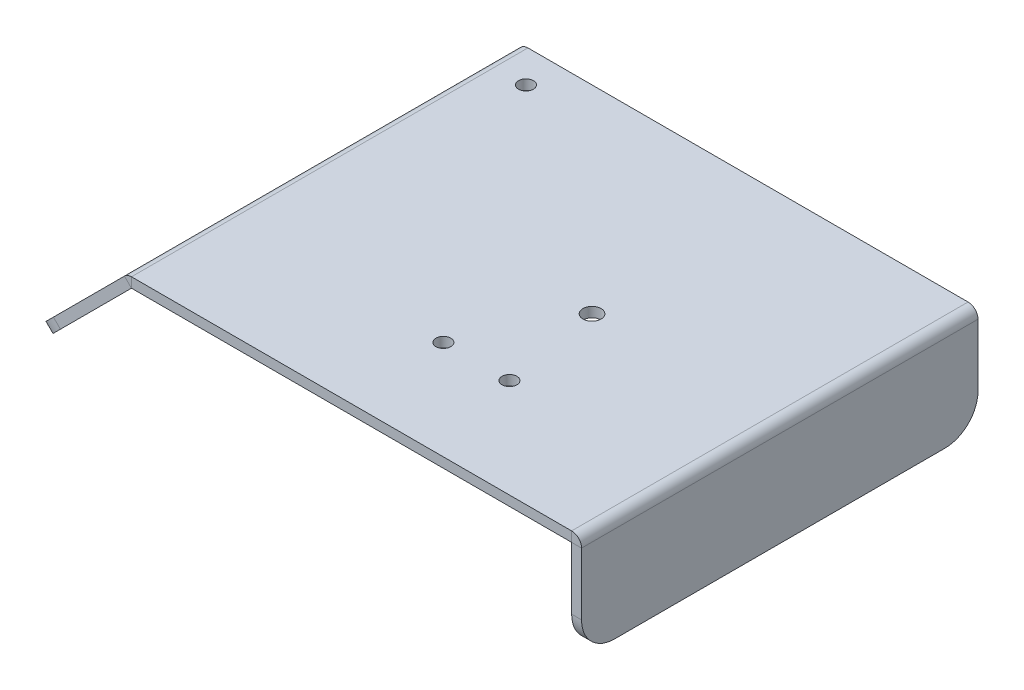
ISO-10303-21;
HEADER;
FILE_DESCRIPTION(('STEP AP214'),'2;1');
FILE_NAME('part.step','',(''),(''),'','','');
FILE_SCHEMA(('AUTOMOTIVE_DESIGN { 1 0 10303 214 1 1 1 1 }'));
ENDSEC;
DATA;
#1=APPLICATION_CONTEXT('core data for automotive mechanical design processes');
#2=APPLICATION_PROTOCOL_DEFINITION('international standard','automotive_design',2000,#1);
#3=PRODUCT_CONTEXT('',#1,'mechanical');
#4=PRODUCT('Part','Part','',(#3));
#5=PRODUCT_RELATED_PRODUCT_CATEGORY('part','',(#4));
#6=PRODUCT_DEFINITION_FORMATION('','',#4);
#7=PRODUCT_DEFINITION_CONTEXT('part definition',#1,'design');
#8=PRODUCT_DEFINITION('design','',#6,#7);
#9=PRODUCT_DEFINITION_SHAPE('','',#8);
#10=(LENGTH_UNIT() NAMED_UNIT(*) SI_UNIT(.MILLI.,.METRE.));
#11=(NAMED_UNIT(*) PLANE_ANGLE_UNIT() SI_UNIT($,.RADIAN.));
#12=(NAMED_UNIT(*) SI_UNIT($,.STERADIAN.) SOLID_ANGLE_UNIT());
#13=UNCERTAINTY_MEASURE_WITH_UNIT(LENGTH_MEASURE(1.E-05),#10,'distance_accuracy_value','');
#14=(GEOMETRIC_REPRESENTATION_CONTEXT(3) GLOBAL_UNCERTAINTY_ASSIGNED_CONTEXT((#13)) GLOBAL_UNIT_ASSIGNED_CONTEXT((#10,
#11,#12)) REPRESENTATION_CONTEXT('',''));
#15=CARTESIAN_POINT('',(0.,0.,0.));
#16=DIRECTION('',(0.,0.,1.));
#17=DIRECTION('',(1.,0.,0.));
#18=AXIS2_PLACEMENT_3D('',#15,#16,#17);
#19=CARTESIAN_POINT('',(10.0000000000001,3.,0.));
#20=DIRECTION('',(0.,0.,-1.));
#21=DIRECTION('',(-1.,0.,0.));
#22=AXIS2_PLACEMENT_3D('',#19,#20,#21);
#23=PLANE('',#22);
#24=DIRECTION('',(1.,0.,0.));
#25=VECTOR('',#24,1.);
#26=CARTESIAN_POINT('',(10.0000000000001,3.,0.));
#27=LINE('',#26,#25);
#28=CARTESIAN_POINT('',(41.5929756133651,2.99999997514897,0.));
#29=VERTEX_POINT('',#28);
#30=CARTESIAN_POINT('',(174.81404877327,3.,0.));
#31=VERTEX_POINT('',#30);
#32=EDGE_CURVE('E43',#29,#31,#27,.T.);
#33=ORIENTED_EDGE('',*,*,#32,.F.);
#34=DIRECTION('',(0.,-1.,0.));
#35=VECTOR('',#34,1.);
#36=CARTESIAN_POINT('',(41.5929756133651,3.,0.));
#37=LINE('',#36,#35);
#38=CARTESIAN_POINT('',(41.5929756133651,0.,0.));
#39=VERTEX_POINT('',#38);
#40=EDGE_CURVE('E12',#29,#39,#37,.T.);
#41=ORIENTED_EDGE('',*,*,#40,.T.);
#42=DIRECTION('',(1.,0.,0.));
#43=VECTOR('',#42,1.);
#44=CARTESIAN_POINT('',(10.0000000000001,0.,0.));
#45=LINE('',#44,#43);
#46=CARTESIAN_POINT('',(174.81404877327,0.,0.));
#47=VERTEX_POINT('',#46);
#48=EDGE_CURVE('E227',#39,#47,#45,.T.);
#49=ORIENTED_EDGE('',*,*,#48,.T.);
#50=DIRECTION('',(0.,-1.,0.));
#51=VECTOR('',#50,1.);
#52=CARTESIAN_POINT('',(174.81404877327,3.,0.));
#53=LINE('',#52,#51);
#54=EDGE_CURVE('E223',#31,#47,#53,.T.);
#55=ORIENTED_EDGE('',*,*,#54,.F.);
#56=EDGE_LOOP('',(#33,#41,#49,#55));
#57=FACE_BOUND('',#56,.T.);
#58=ADVANCED_FACE('F40',(#57),#23,.F.);
#59=CARTESIAN_POINT('',(196.,0.,-110.));
#60=DIRECTION('',(0.,1.,0.));
#61=DIRECTION('',(0.,0.,1.));
#62=AXIS2_PLACEMENT_3D('',#59,#60,#61);
#63=PLANE('',#62);
#64=CARTESIAN_POINT('',(121.,0.,-60.));
#65=DIRECTION('',(0.,1.,0.));
#66=DIRECTION('',(0.,0.,1.));
#67=AXIS2_PLACEMENT_3D('',#64,#65,#66);
#68=CIRCLE('',#67,2.75000000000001);
#69=CARTESIAN_POINT('',(121.,0.,-57.25));
#70=VERTEX_POINT('',#69);
#71=EDGE_CURVE('E224',#70,#70,#68,.T.);
#72=ORIENTED_EDGE('',*,*,#71,.T.);
#73=EDGE_LOOP('',(#72));
#74=FACE_BOUND('',#73,.T.);
#75=CARTESIAN_POINT('',(106.,0.,-30.));
#76=DIRECTION('',(0.,1.,0.));
#77=DIRECTION('',(0.,0.,1.));
#78=AXIS2_PLACEMENT_3D('',#75,#76,#77);
#79=CIRCLE('',#78,2.25);
#80=CARTESIAN_POINT('',(106.,0.,-27.75));
#81=VERTEX_POINT('',#80);
#82=EDGE_CURVE('E228',#81,#81,#79,.T.);
#83=ORIENTED_EDGE('',*,*,#82,.T.);
#84=EDGE_LOOP('',(#83));
#85=FACE_BOUND('',#84,.T.);
#86=CARTESIAN_POINT('',(51.,0.,-110.));
#87=DIRECTION('',(0.,1.,0.));
#88=DIRECTION('',(0.,0.,1.));
#89=AXIS2_PLACEMENT_3D('',#86,#87,#88);
#90=CIRCLE('',#89,2.25);
#91=CARTESIAN_POINT('',(51.,0.,-107.75));
#92=VERTEX_POINT('',#91);
#93=EDGE_CURVE('E231',#92,#92,#90,.T.);
#94=ORIENTED_EDGE('',*,*,#93,.T.);
#95=EDGE_LOOP('',(#94));
#96=FACE_BOUND('',#95,.T.);
#97=CARTESIAN_POINT('',(126.,0.,-30.));
#98=DIRECTION('',(0.,1.,0.));
#99=DIRECTION('',(0.,0.,1.));
#100=AXIS2_PLACEMENT_3D('',#97,#98,#99);
#101=CIRCLE('',#100,2.25000000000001);
#102=CARTESIAN_POINT('',(126.,0.,-27.75));
#103=VERTEX_POINT('',#102);
#104=EDGE_CURVE('E234',#103,#103,#101,.T.);
#105=ORIENTED_EDGE('',*,*,#104,.T.);
#106=EDGE_LOOP('',(#105));
#107=FACE_BOUND('',#106,.T.);
#108=ORIENTED_EDGE('',*,*,#48,.F.);
#109=DIRECTION('',(0.,0.,-1.));
#110=VECTOR('',#109,1.);
#111=CARTESIAN_POINT('',(41.5929756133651,0.,-110.));
#112=LINE('',#111,#110);
#113=CARTESIAN_POINT('',(41.5929756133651,-2.9114793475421E-08,-120.));
#114=VERTEX_POINT('',#113);
#115=EDGE_CURVE('E48',#39,#114,#112,.T.);
#116=ORIENTED_EDGE('',*,*,#115,.T.);
#117=DIRECTION('',(-1.,0.,0.));
#118=VECTOR('',#117,1.);
#119=CARTESIAN_POINT('',(10.0000000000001,0.,-120.));
#120=LINE('',#119,#118);
#121=CARTESIAN_POINT('',(174.81404877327,0.,-120.));
#122=VERTEX_POINT('',#121);
#123=EDGE_CURVE('E237',#122,#114,#120,.T.);
#124=ORIENTED_EDGE('',*,*,#123,.F.);
#125=DIRECTION('',(0.,0.,-1.));
#126=VECTOR('',#125,1.);
#127=CARTESIAN_POINT('',(174.81404877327,0.,-110.));
#128=LINE('',#127,#126);
#129=EDGE_CURVE('E257',#47,#122,#128,.T.);
#130=ORIENTED_EDGE('',*,*,#129,.F.);
#131=EDGE_LOOP('',(#108,#116,#124,#130));
#132=FACE_BOUND('',#131,.T.);
#133=ADVANCED_FACE('F375',(#74,#85,#96,#107,#132),#63,.F.);
#134=CARTESIAN_POINT('',(10.0000000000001,3.,-120.));
#135=DIRECTION('',(0.,0.,1.));
#136=DIRECTION('',(1.,0.,0.));
#137=AXIS2_PLACEMENT_3D('',#134,#135,#136);
#138=PLANE('',#137);
#139=ORIENTED_EDGE('',*,*,#123,.T.);
#140=DIRECTION('',(0.,1.,0.));
#141=VECTOR('',#140,1.);
#142=CARTESIAN_POINT('',(41.5929756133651,3.,-120.));
#143=LINE('',#142,#141);
#144=CARTESIAN_POINT('',(41.5929756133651,2.99999997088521,-120.));
#145=VERTEX_POINT('',#144);
#146=EDGE_CURVE('E307',#114,#145,#143,.T.);
#147=ORIENTED_EDGE('',*,*,#146,.T.);
#148=DIRECTION('',(-1.,0.,0.));
#149=VECTOR('',#148,1.);
#150=CARTESIAN_POINT('',(10.0000000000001,3.,-120.));
#151=LINE('',#150,#149);
#152=CARTESIAN_POINT('',(174.81404877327,3.00000012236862,-120.));
#153=VERTEX_POINT('',#152);
#154=EDGE_CURVE('E241',#153,#145,#151,.T.);
#155=ORIENTED_EDGE('',*,*,#154,.F.);
#156=DIRECTION('',(0.,1.,0.));
#157=VECTOR('',#156,1.);
#158=CARTESIAN_POINT('',(174.81404877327,3.,-120.));
#159=LINE('',#158,#157);
#160=EDGE_CURVE('E254',#122,#153,#159,.T.);
#161=ORIENTED_EDGE('',*,*,#160,.F.);
#162=EDGE_LOOP('',(#139,#147,#155,#161));
#163=FACE_BOUND('',#162,.T.);
#164=ADVANCED_FACE('F323',(#163),#138,.F.);
#165=CARTESIAN_POINT('',(177.82404877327,167.17595122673,0.));
#166=DIRECTION('',(0.,0.,-1.));
#167=DIRECTION('',(0.,1.,0.));
#168=AXIS2_PLACEMENT_3D('',#165,#166,#167);
#169=PLANE('',#168);
#170=DIRECTION('',(0.,-1.,0.));
#171=VECTOR('',#170,1.);
#172=CARTESIAN_POINT('',(177.82404877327,167.17595122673,0.));
#173=LINE('',#172,#171);
#174=CARTESIAN_POINT('',(177.82404877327,-0.01000000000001,0.));
#175=VERTEX_POINT('',#174);
#176=CARTESIAN_POINT('',(177.82404877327,-18.8240487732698,0.));
#177=VERTEX_POINT('',#176);
#178=EDGE_CURVE('E277',#175,#177,#173,.T.);
#179=ORIENTED_EDGE('',*,*,#178,.F.);
#180=DIRECTION('',(-1.,0.,0.));
#181=VECTOR('',#180,1.);
#182=CARTESIAN_POINT('',(177.82404877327,-0.01000000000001,0.));
#183=LINE('',#182,#181);
#184=CARTESIAN_POINT('',(174.82404877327,-0.01000000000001,0.));
#185=VERTEX_POINT('',#184);
#186=EDGE_CURVE('E298',#175,#185,#183,.T.);
#187=ORIENTED_EDGE('',*,*,#186,.T.);
#188=DIRECTION('',(0.,-1.,0.));
#189=VECTOR('',#188,1.);
#190=CARTESIAN_POINT('',(174.82404877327,167.17595122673,0.));
#191=LINE('',#190,#189);
#192=CARTESIAN_POINT('',(174.82404877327,-18.8240487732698,0.));
#193=VERTEX_POINT('',#192);
#194=EDGE_CURVE('E64',#185,#193,#191,.T.);
#195=ORIENTED_EDGE('',*,*,#194,.T.);
#196=DIRECTION('',(-1.,0.,0.));
#197=VECTOR('',#196,1.);
#198=CARTESIAN_POINT('',(177.82404877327,-18.8240487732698,0.));
#199=LINE('',#198,#197);
#200=EDGE_CURVE('E285',#177,#193,#199,.T.);
#201=ORIENTED_EDGE('',*,*,#200,.F.);
#202=EDGE_LOOP('',(#179,#187,#195,#201));
#203=FACE_BOUND('',#202,.T.);
#204=ADVANCED_FACE('F394',(#203),#169,.F.);
#205=CARTESIAN_POINT('',(177.82404877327,167.17595122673,-120.));
#206=DIRECTION('',(0.,0.,1.));
#207=DIRECTION('',(0.,-1.,0.));
#208=AXIS2_PLACEMENT_3D('',#205,#206,#207);
#209=PLANE('',#208);
#210=DIRECTION('',(0.,1.,0.));
#211=VECTOR('',#210,1.);
#212=CARTESIAN_POINT('',(174.82404877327,167.17595122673,-120.));
#213=LINE('',#212,#211);
#214=CARTESIAN_POINT('',(174.82404877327,-18.8240487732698,-120.));
#215=VERTEX_POINT('',#214);
#216=CARTESIAN_POINT('',(174.82404877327,-0.01000000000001,-120.));
#217=VERTEX_POINT('',#216);
#218=EDGE_CURVE('E265',#215,#217,#213,.T.);
#219=ORIENTED_EDGE('',*,*,#218,.T.);
#220=DIRECTION('',(1.,0.,0.));
#221=VECTOR('',#220,1.);
#222=CARTESIAN_POINT('',(177.82404877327,-0.01000000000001,-120.));
#223=LINE('',#222,#221);
#224=CARTESIAN_POINT('',(177.824048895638,-0.0100000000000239,-120.));
#225=VERTEX_POINT('',#224);
#226=EDGE_CURVE('E294',#217,#225,#223,.T.);
#227=ORIENTED_EDGE('',*,*,#226,.T.);
#228=DIRECTION('',(0.,1.,0.));
#229=VECTOR('',#228,1.);
#230=CARTESIAN_POINT('',(177.82404877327,167.17595122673,-120.));
#231=LINE('',#230,#229);
#232=CARTESIAN_POINT('',(177.82404877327,-18.8240487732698,-120.));
#233=VERTEX_POINT('',#232);
#234=EDGE_CURVE('E273',#233,#225,#231,.T.);
#235=ORIENTED_EDGE('',*,*,#234,.F.);
#236=DIRECTION('',(-1.,0.,0.));
#237=VECTOR('',#236,1.);
#238=CARTESIAN_POINT('',(177.82404877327,-18.8240487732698,-120.));
#239=LINE('',#238,#237);
#240=EDGE_CURVE('E288',#233,#215,#239,.T.);
#241=ORIENTED_EDGE('',*,*,#240,.T.);
#242=EDGE_LOOP('',(#219,#227,#235,#241));
#243=FACE_BOUND('',#242,.T.);
#244=ADVANCED_FACE('F405',(#243),#209,.F.);
#245=CARTESIAN_POINT('',(174.82404877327,-18.8240487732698,-110.));
#246=DIRECTION('',(1.,0.,0.));
#247=DIRECTION('',(0.,0.,1.));
#248=AXIS2_PLACEMENT_3D('',#245,#246,#247);
#249=PLANE('',#248);
#250=ORIENTED_EDGE('',*,*,#194,.F.);
#251=DIRECTION('',(0.,0.,-1.));
#252=VECTOR('',#251,1.);
#253=CARTESIAN_POINT('',(174.82404877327,-0.01000000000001,-110.));
#254=LINE('',#253,#252);
#255=EDGE_CURVE('E296',#185,#217,#254,.T.);
#256=ORIENTED_EDGE('',*,*,#255,.T.);
#257=ORIENTED_EDGE('',*,*,#218,.F.);
#258=CARTESIAN_POINT('',(174.82404877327,-18.8240487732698,-110.));
#259=DIRECTION('',(1.,0.,0.));
#260=DIRECTION('',(0.,0.,1.));
#261=AXIS2_PLACEMENT_3D('',#258,#259,#260);
#262=CIRCLE('',#261,10.);
#263=CARTESIAN_POINT('',(174.82404877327,-28.8240487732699,-110.));
#264=VERTEX_POINT('',#263);
#265=EDGE_CURVE('E262',#264,#215,#262,.T.);
#266=ORIENTED_EDGE('',*,*,#265,.F.);
#267=DIRECTION('',(0.,0.,-1.));
#268=VECTOR('',#267,1.);
#269=CARTESIAN_POINT('',(174.82404877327,-28.8240487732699,-10.0000000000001));
#270=LINE('',#269,#268);
#271=CARTESIAN_POINT('',(174.82404877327,-28.8240487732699,-10.0000000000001));
#272=VERTEX_POINT('',#271);
#273=EDGE_CURVE('E268',#272,#264,#270,.T.);
#274=ORIENTED_EDGE('',*,*,#273,.F.);
#275=CARTESIAN_POINT('',(174.82404877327,-18.8240487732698,-10.));
#276=DIRECTION('',(1.,0.,0.));
#277=DIRECTION('',(0.,0.,1.));
#278=AXIS2_PLACEMENT_3D('',#275,#276,#277);
#279=CIRCLE('',#278,10.);
#280=EDGE_CURVE('E266',#193,#272,#279,.T.);
#281=ORIENTED_EDGE('',*,*,#280,.F.);
#282=EDGE_LOOP('',(#250,#256,#257,#266,#274,#281));
#283=FACE_BOUND('',#282,.T.);
#284=ADVANCED_FACE('F400',(#283),#249,.F.);
#285=CARTESIAN_POINT('',(177.82404877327,-18.8240487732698,-110.));
#286=DIRECTION('',(1.,0.,0.));
#287=DIRECTION('',(0.,0.,1.));
#288=AXIS2_PLACEMENT_3D('',#285,#286,#287);
#289=PLANE('',#288);
#290=DIRECTION('',(0.,0.,-1.));
#291=VECTOR('',#290,1.);
#292=CARTESIAN_POINT('',(177.82404877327,-0.01000000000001,-110.));
#293=LINE('',#292,#291);
#294=EDGE_CURVE('E291',#175,#225,#293,.T.);
#295=ORIENTED_EDGE('',*,*,#294,.F.);
#296=ORIENTED_EDGE('',*,*,#178,.T.);
#297=CARTESIAN_POINT('',(177.82404877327,-18.8240487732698,-10.));
#298=DIRECTION('',(1.,0.,0.));
#299=DIRECTION('',(0.,0.,1.));
#300=AXIS2_PLACEMENT_3D('',#297,#298,#299);
#301=CIRCLE('',#300,10.);
#302=CARTESIAN_POINT('',(177.82404877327,-28.8240487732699,-10.0000000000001));
#303=VERTEX_POINT('',#302);
#304=EDGE_CURVE('E274',#177,#303,#301,.T.);
#305=ORIENTED_EDGE('',*,*,#304,.T.);
#306=DIRECTION('',(0.,0.,-1.));
#307=VECTOR('',#306,1.);
#308=CARTESIAN_POINT('',(177.82404877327,-28.8240487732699,-10.0000000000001));
#309=LINE('',#308,#307);
#310=CARTESIAN_POINT('',(177.82404877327,-28.8240487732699,-110.));
#311=VERTEX_POINT('',#310);
#312=EDGE_CURVE('E276',#303,#311,#309,.T.);
#313=ORIENTED_EDGE('',*,*,#312,.T.);
#314=CARTESIAN_POINT('',(177.82404877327,-18.8240487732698,-110.));
#315=DIRECTION('',(1.,0.,0.));
#316=DIRECTION('',(0.,0.,1.));
#317=AXIS2_PLACEMENT_3D('',#314,#315,#316);
#318=CIRCLE('',#317,10.);
#319=EDGE_CURVE('E270',#311,#233,#318,.T.);
#320=ORIENTED_EDGE('',*,*,#319,.T.);
#321=ORIENTED_EDGE('',*,*,#234,.T.);
#322=EDGE_LOOP('',(#295,#296,#305,#313,#320,#321));
#323=FACE_BOUND('',#322,.T.);
#324=ADVANCED_FACE('F407',(#323),#289,.T.);
#325=CARTESIAN_POINT('',(177.82404877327,-18.8240487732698,-110.));
#326=DIRECTION('',(-1.,0.,0.));
#327=DIRECTION('',(0.,0.,-1.));
#328=AXIS2_PLACEMENT_3D('',#325,#326,#327);
#329=CYLINDRICAL_SURFACE('',#328,10.);
#330=ORIENTED_EDGE('',*,*,#265,.T.);
#331=ORIENTED_EDGE('',*,*,#240,.F.);
#332=ORIENTED_EDGE('',*,*,#319,.F.);
#333=DIRECTION('',(-1.,0.,0.));
#334=VECTOR('',#333,1.);
#335=CARTESIAN_POINT('',(177.82404877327,-28.8240487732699,-110.));
#336=LINE('',#335,#334);
#337=EDGE_CURVE('E279',#311,#264,#336,.T.);
#338=ORIENTED_EDGE('',*,*,#337,.T.);
#339=EDGE_LOOP('',(#330,#331,#332,#338));
#340=FACE_BOUND('',#339,.T.);
#341=ADVANCED_FACE('F413',(#340),#329,.T.);
#342=CARTESIAN_POINT('',(177.82404877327,-18.8240487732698,-10.));
#343=DIRECTION('',(-1.,0.,0.));
#344=DIRECTION('',(0.,0.,-1.));
#345=AXIS2_PLACEMENT_3D('',#342,#343,#344);
#346=CYLINDRICAL_SURFACE('',#345,10.);
#347=ORIENTED_EDGE('',*,*,#280,.T.);
#348=DIRECTION('',(-1.,0.,0.));
#349=VECTOR('',#348,1.);
#350=CARTESIAN_POINT('',(177.82404877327,-28.8240487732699,-10.0000000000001));
#351=LINE('',#350,#349);
#352=EDGE_CURVE('E282',#303,#272,#351,.T.);
#353=ORIENTED_EDGE('',*,*,#352,.F.);
#354=ORIENTED_EDGE('',*,*,#304,.F.);
#355=ORIENTED_EDGE('',*,*,#200,.T.);
#356=EDGE_LOOP('',(#347,#353,#354,#355));
#357=FACE_BOUND('',#356,.T.);
#358=ADVANCED_FACE('F420',(#357),#346,.T.);
#359=CARTESIAN_POINT('',(177.82404877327,-28.8240487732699,-10.0000000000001));
#360=DIRECTION('',(0.,1.,0.));
#361=DIRECTION('',(0.,0.,1.));
#362=AXIS2_PLACEMENT_3D('',#359,#360,#361);
#363=PLANE('',#362);
#364=ORIENTED_EDGE('',*,*,#273,.T.);
#365=ORIENTED_EDGE('',*,*,#337,.F.);
#366=ORIENTED_EDGE('',*,*,#312,.F.);
#367=ORIENTED_EDGE('',*,*,#352,.T.);
#368=EDGE_LOOP('',(#364,#365,#366,#367));
#369=FACE_BOUND('',#368,.T.);
#370=ADVANCED_FACE('F416',(#369),#363,.F.);
#371=CARTESIAN_POINT('',(121.,3.,-60.));
#372=DIRECTION('',(0.,-1.,0.));
#373=DIRECTION('',(0.,0.,-1.));
#374=AXIS2_PLACEMENT_3D('',#371,#372,#373);
#375=CYLINDRICAL_SURFACE('',#374,2.75000000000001);
#376=CARTESIAN_POINT('',(121.,3.,-60.));
#377=DIRECTION('',(0.,1.,0.));
#378=DIRECTION('',(0.,0.,1.));
#379=AXIS2_PLACEMENT_3D('',#376,#377,#378);
#380=CIRCLE('',#379,2.75000000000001);
#381=CARTESIAN_POINT('',(121.,3.,-57.25));
#382=VERTEX_POINT('',#381);
#383=EDGE_CURVE('E251',#382,#382,#380,.T.);
#384=ORIENTED_EDGE('',*,*,#383,.T.);
#385=EDGE_LOOP('',(#384));
#386=FACE_BOUND('',#385,.T.);
#387=ORIENTED_EDGE('',*,*,#71,.F.);
#388=EDGE_LOOP('',(#387));
#389=FACE_BOUND('',#388,.T.);
#390=ADVANCED_FACE('F427',(#386,#389),#375,.F.);
#391=CARTESIAN_POINT('',(106.,3.,-30.));
#392=DIRECTION('',(0.,-1.,0.));
#393=DIRECTION('',(0.,0.,-1.));
#394=AXIS2_PLACEMENT_3D('',#391,#392,#393);
#395=CYLINDRICAL_SURFACE('',#394,2.25);
#396=CARTESIAN_POINT('',(106.,3.,-30.));
#397=DIRECTION('',(0.,1.,0.));
#398=DIRECTION('',(0.,0.,1.));
#399=AXIS2_PLACEMENT_3D('',#396,#397,#398);
#400=CIRCLE('',#399,2.25);
#401=CARTESIAN_POINT('',(106.,3.,-27.75));
#402=VERTEX_POINT('',#401);
#403=EDGE_CURVE('E248',#402,#402,#400,.T.);
#404=ORIENTED_EDGE('',*,*,#403,.T.);
#405=EDGE_LOOP('',(#404));
#406=FACE_BOUND('',#405,.T.);
#407=ORIENTED_EDGE('',*,*,#82,.F.);
#408=EDGE_LOOP('',(#407));
#409=FACE_BOUND('',#408,.T.);
#410=ADVANCED_FACE('F492',(#406,#409),#395,.F.);
#411=CARTESIAN_POINT('',(51.,3.,-110.));
#412=DIRECTION('',(0.,-1.,0.));
#413=DIRECTION('',(0.,0.,-1.));
#414=AXIS2_PLACEMENT_3D('',#411,#412,#413);
#415=CYLINDRICAL_SURFACE('',#414,2.25);
#416=CARTESIAN_POINT('',(51.,3.,-110.));
#417=DIRECTION('',(0.,1.,0.));
#418=DIRECTION('',(0.,0.,1.));
#419=AXIS2_PLACEMENT_3D('',#416,#417,#418);
#420=CIRCLE('',#419,2.25);
#421=CARTESIAN_POINT('',(51.,3.,-107.75));
#422=VERTEX_POINT('',#421);
#423=EDGE_CURVE('E245',#422,#422,#420,.T.);
#424=ORIENTED_EDGE('',*,*,#423,.T.);
#425=EDGE_LOOP('',(#424));
#426=FACE_BOUND('',#425,.T.);
#427=ORIENTED_EDGE('',*,*,#93,.F.);
#428=EDGE_LOOP('',(#427));
#429=FACE_BOUND('',#428,.T.);
#430=ADVANCED_FACE('F504',(#426,#429),#415,.F.);
#431=CARTESIAN_POINT('',(126.,3.,-30.));
#432=DIRECTION('',(0.,-1.,0.));
#433=DIRECTION('',(0.,0.,-1.));
#434=AXIS2_PLACEMENT_3D('',#431,#432,#433);
#435=CYLINDRICAL_SURFACE('',#434,2.25000000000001);
#436=CARTESIAN_POINT('',(126.,3.,-30.));
#437=DIRECTION('',(0.,1.,0.));
#438=DIRECTION('',(0.,0.,1.));
#439=AXIS2_PLACEMENT_3D('',#436,#437,#438);
#440=CIRCLE('',#439,2.25000000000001);
#441=CARTESIAN_POINT('',(126.,3.,-27.75));
#442=VERTEX_POINT('',#441);
#443=EDGE_CURVE('E242',#442,#442,#440,.T.);
#444=ORIENTED_EDGE('',*,*,#443,.T.);
#445=EDGE_LOOP('',(#444));
#446=FACE_BOUND('',#445,.T.);
#447=ORIENTED_EDGE('',*,*,#104,.F.);
#448=EDGE_LOOP('',(#447));
#449=FACE_BOUND('',#448,.T.);
#450=ADVANCED_FACE('F442',(#446,#449),#435,.F.);
#451=CARTESIAN_POINT('',(196.,3.,-110.));
#452=DIRECTION('',(0.,1.,0.));
#453=DIRECTION('',(0.,0.,1.));
#454=AXIS2_PLACEMENT_3D('',#451,#452,#453);
#455=PLANE('',#454);
#456=DIRECTION('',(0.,0.,-1.));
#457=VECTOR('',#456,1.);
#458=CARTESIAN_POINT('',(41.5929756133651,3.,-110.));
#459=LINE('',#458,#457);
#460=EDGE_CURVE('E300',#29,#145,#459,.T.);
#461=ORIENTED_EDGE('',*,*,#460,.F.);
#462=ORIENTED_EDGE('',*,*,#32,.T.);
#463=DIRECTION('',(0.,0.,-1.));
#464=VECTOR('',#463,1.);
#465=CARTESIAN_POINT('',(174.81404877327,3.,-110.));
#466=LINE('',#465,#464);
#467=EDGE_CURVE('E238',#31,#153,#466,.T.);
#468=ORIENTED_EDGE('',*,*,#467,.T.);
#469=ORIENTED_EDGE('',*,*,#154,.T.);
#470=EDGE_LOOP('',(#461,#462,#468,#469));
#471=FACE_BOUND('',#470,.T.);
#472=ORIENTED_EDGE('',*,*,#443,.F.);
#473=EDGE_LOOP('',(#472));
#474=FACE_BOUND('',#473,.T.);
#475=ORIENTED_EDGE('',*,*,#423,.F.);
#476=EDGE_LOOP('',(#475));
#477=FACE_BOUND('',#476,.T.);
#478=ORIENTED_EDGE('',*,*,#403,.F.);
#479=EDGE_LOOP('',(#478));
#480=FACE_BOUND('',#479,.T.);
#481=ORIENTED_EDGE('',*,*,#383,.F.);
#482=EDGE_LOOP('',(#481));
#483=FACE_BOUND('',#482,.T.);
#484=ADVANCED_FACE('F317',(#471,#474,#477,#480,#483),#455,.T.);
#485=CARTESIAN_POINT('',(174.81404877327,-0.0100001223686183,0.));
#486=DIRECTION('',(0.,0.,1.));
#487=DIRECTION('',(0.,-1.,0.));
#488=AXIS2_PLACEMENT_3D('',#485,#486,#487);
#489=PLANE('',#488);
#490=ORIENTED_EDGE('',*,*,#54,.T.);
#491=CARTESIAN_POINT('',(174.81404877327,-0.01,0.));
#492=DIRECTION('',(0.,0.,-1.));
#493=DIRECTION('',(-1.,0.,0.));
#494=AXIS2_PLACEMENT_3D('',#491,#492,#493);
#495=CIRCLE('',#494,0.0100001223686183);
#496=EDGE_CURVE('E211',#47,#185,#495,.T.);
#497=ORIENTED_EDGE('',*,*,#496,.T.);
#498=ORIENTED_EDGE('',*,*,#186,.F.);
#499=CARTESIAN_POINT('',(174.81404877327,-0.0100001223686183,0.));
#500=DIRECTION('',(0.,0.,-1.));
#501=DIRECTION('',(0.,1.,0.));
#502=AXIS2_PLACEMENT_3D('',#499,#500,#501);
#503=CIRCLE('',#502,3.01000018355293);
#504=EDGE_CURVE('E217',#31,#175,#503,.T.);
#505=ORIENTED_EDGE('',*,*,#504,.F.);
#506=EDGE_LOOP('',(#490,#497,#498,#505));
#507=FACE_BOUND('',#506,.T.);
#508=ADVANCED_FACE('F390',(#507),#489,.T.);
#509=CARTESIAN_POINT('',(174.81404877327,-0.0100001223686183,-120.));
#510=DIRECTION('',(0.,0.,-1.));
#511=DIRECTION('',(-1.,0.,0.));
#512=AXIS2_PLACEMENT_3D('',#509,#510,#511);
#513=PLANE('',#512);
#514=CARTESIAN_POINT('',(174.81404877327,-0.01,-120.));
#515=DIRECTION('',(0.,0.,-1.));
#516=DIRECTION('',(-1.,0.,0.));
#517=AXIS2_PLACEMENT_3D('',#514,#515,#516);
#518=CIRCLE('',#517,0.0100001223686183);
#519=EDGE_CURVE('E214',#217,#122,#518,.F.);
#520=ORIENTED_EDGE('',*,*,#519,.T.);
#521=ORIENTED_EDGE('',*,*,#160,.T.);
#522=CARTESIAN_POINT('',(174.81404877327,-0.0100001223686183,-120.));
#523=DIRECTION('',(0.,0.,1.));
#524=DIRECTION('',(1.,0.,0.));
#525=AXIS2_PLACEMENT_3D('',#522,#523,#524);
#526=CIRCLE('',#525,3.01000018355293);
#527=EDGE_CURVE('E220',#225,#153,#526,.T.);
#528=ORIENTED_EDGE('',*,*,#527,.F.);
#529=ORIENTED_EDGE('',*,*,#226,.F.);
#530=EDGE_LOOP('',(#520,#521,#528,#529));
#531=FACE_BOUND('',#530,.T.);
#532=ADVANCED_FACE('F403',(#531),#513,.T.);
#533=CARTESIAN_POINT('',(174.81404877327,-0.01,60.0609258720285));
#534=DIRECTION('',(0.,0.,-1.));
#535=DIRECTION('',(-1.,0.,0.));
#536=AXIS2_PLACEMENT_3D('',#533,#534,#535);
#537=CYLINDRICAL_SURFACE('',#536,3.01000012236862);
#538=ORIENTED_EDGE('',*,*,#294,.T.);
#539=ORIENTED_EDGE('',*,*,#527,.T.);
#540=ORIENTED_EDGE('',*,*,#467,.F.);
#541=ORIENTED_EDGE('',*,*,#504,.T.);
#542=EDGE_LOOP('',(#538,#539,#540,#541));
#543=FACE_BOUND('',#542,.T.);
#544=ADVANCED_FACE('F387',(#543),#537,.T.);
#545=CARTESIAN_POINT('',(174.81404877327,-0.01,60.0609258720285));
#546=DIRECTION('',(0.,0.,-1.));
#547=DIRECTION('',(-1.,0.,0.));
#548=AXIS2_PLACEMENT_3D('',#545,#546,#547);
#549=CYLINDRICAL_SURFACE('',#548,0.0100001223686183);
#550=ORIENTED_EDGE('',*,*,#255,.F.);
#551=ORIENTED_EDGE('',*,*,#496,.F.);
#552=ORIENTED_EDGE('',*,*,#129,.T.);
#553=ORIENTED_EDGE('',*,*,#519,.F.);
#554=EDGE_LOOP('',(#550,#551,#552,#553));
#555=FACE_BOUND('',#554,.T.);
#556=ADVANCED_FACE('F398',(#555),#549,.F.);
#557=CARTESIAN_POINT('',(41.5929756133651,-0.00999997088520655,0.));
#558=DIRECTION('',(0.,0.,1.));
#559=DIRECTION('',(1.,0.,0.));
#560=AXIS2_PLACEMENT_3D('',#557,#558,#559);
#561=PLANE('',#560);
#562=DIRECTION('',(0.707106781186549,-0.707106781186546,0.));
#563=VECTOR('',#562,1.);
#564=CARTESIAN_POINT('',(39.4645842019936,2.1183914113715,0.));
#565=LINE('',#564,#563);
#566=CARTESIAN_POINT('',(39.4645842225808,2.11839139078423,0.));
#567=VERTEX_POINT('',#566);
#568=CARTESIAN_POINT('',(41.5859045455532,-0.00292893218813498,0.));
#569=VERTEX_POINT('',#568);
#570=EDGE_CURVE('E198',#567,#569,#565,.T.);
#571=ORIENTED_EDGE('',*,*,#570,.T.);
#572=CARTESIAN_POINT('',(41.5929756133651,-0.01,0.));
#573=DIRECTION('',(0.,0.,1.));
#574=DIRECTION('',(1.,0.,0.));
#575=AXIS2_PLACEMENT_3D('',#572,#573,#574);
#576=CIRCLE('',#575,0.00999997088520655);
#577=EDGE_CURVE('E56',#569,#39,#576,.F.);
#578=ORIENTED_EDGE('',*,*,#577,.T.);
#579=ORIENTED_EDGE('',*,*,#40,.F.);
#580=CARTESIAN_POINT('',(41.5929756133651,-0.00999997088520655,0.));
#581=DIRECTION('',(0.,0.,-1.));
#582=DIRECTION('',(-1.,0.,0.));
#583=AXIS2_PLACEMENT_3D('',#580,#581,#582);
#584=CIRCLE('',#583,3.00999994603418);
#585=EDGE_CURVE('E205',#567,#29,#584,.T.);
#586=ORIENTED_EDGE('',*,*,#585,.F.);
#587=EDGE_LOOP('',(#571,#578,#579,#586));
#588=FACE_BOUND('',#587,.T.);
#589=ADVANCED_FACE('F333',(#588),#561,.T.);
#590=CARTESIAN_POINT('',(41.5929756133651,-0.00999997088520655,-120.));
#591=DIRECTION('',(0.,0.,-1.));
#592=DIRECTION('',(-1.,0.,0.));
#593=AXIS2_PLACEMENT_3D('',#590,#591,#592);
#594=PLANE('',#593);
#595=CARTESIAN_POINT('',(41.5929756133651,-0.01,-120.));
#596=DIRECTION('',(0.,0.,1.));
#597=DIRECTION('',(1.,0.,0.));
#598=AXIS2_PLACEMENT_3D('',#595,#596,#597);
#599=CIRCLE('',#598,0.00999997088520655);
#600=CARTESIAN_POINT('',(41.5859045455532,-0.00292893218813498,-120.));
#601=VERTEX_POINT('',#600);
#602=EDGE_CURVE('E201',#114,#601,#599,.T.);
#603=ORIENTED_EDGE('',*,*,#602,.T.);
#604=DIRECTION('',(-0.707106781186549,0.707106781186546,0.));
#605=VECTOR('',#604,1.);
#606=CARTESIAN_POINT('',(39.4645842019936,2.1183914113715,-120.));
#607=LINE('',#606,#605);
#608=CARTESIAN_POINT('',(39.4645842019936,2.1183914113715,-120.));
#609=VERTEX_POINT('',#608);
#610=EDGE_CURVE('E163',#601,#609,#607,.T.);
#611=ORIENTED_EDGE('',*,*,#610,.T.);
#612=CARTESIAN_POINT('',(41.5929756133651,-0.00999997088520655,-120.));
#613=DIRECTION('',(0.,0.,1.));
#614=DIRECTION('',(1.,0.,0.));
#615=AXIS2_PLACEMENT_3D('',#612,#613,#614);
#616=CIRCLE('',#615,3.00999994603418);
#617=EDGE_CURVE('E208',#145,#609,#616,.T.);
#618=ORIENTED_EDGE('',*,*,#617,.F.);
#619=ORIENTED_EDGE('',*,*,#146,.F.);
#620=EDGE_LOOP('',(#603,#611,#618,#619));
#621=FACE_BOUND('',#620,.T.);
#622=ADVANCED_FACE('F327',(#621),#594,.T.);
#623=CARTESIAN_POINT('',(41.5929756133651,-0.01,-180.043352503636));
#624=DIRECTION('',(0.,0.,1.));
#625=DIRECTION('',(1.,0.,0.));
#626=AXIS2_PLACEMENT_3D('',#623,#624,#625);
#627=CYLINDRICAL_SURFACE('',#626,3.00999997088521);
#628=ORIENTED_EDGE('',*,*,#460,.T.);
#629=ORIENTED_EDGE('',*,*,#617,.T.);
#630=DIRECTION('',(0.,0.,-1.));
#631=VECTOR('',#630,1.);
#632=CARTESIAN_POINT('',(39.4645842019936,2.1183914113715,-110.));
#633=LINE('',#632,#631);
#634=EDGE_CURVE('E343',#567,#609,#633,.T.);
#635=ORIENTED_EDGE('',*,*,#634,.F.);
#636=ORIENTED_EDGE('',*,*,#585,.T.);
#637=EDGE_LOOP('',(#628,#629,#635,#636));
#638=FACE_BOUND('',#637,.T.);
#639=ADVANCED_FACE('F349',(#638),#627,.T.);
#640=CARTESIAN_POINT('',(41.5929756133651,-0.01,-180.043352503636));
#641=DIRECTION('',(0.,0.,1.));
#642=DIRECTION('',(1.,0.,0.));
#643=AXIS2_PLACEMENT_3D('',#640,#641,#642);
#644=CYLINDRICAL_SURFACE('',#643,0.00999997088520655);
#645=ORIENTED_EDGE('',*,*,#115,.F.);
#646=ORIENTED_EDGE('',*,*,#577,.F.);
#647=DIRECTION('',(0.,0.,-1.));
#648=VECTOR('',#647,1.);
#649=CARTESIAN_POINT('',(41.5859045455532,-0.00292893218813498,-110.));
#650=LINE('',#649,#648);
#651=EDGE_CURVE('E196',#569,#601,#650,.T.);
#652=ORIENTED_EDGE('',*,*,#651,.T.);
#653=ORIENTED_EDGE('',*,*,#602,.F.);
#654=EDGE_LOOP('',(#645,#646,#652,#653));
#655=FACE_BOUND('',#654,.T.);
#656=ADVANCED_FACE('F329',(#655),#644,.F.);
#657=CARTESIAN_POINT('',(17.9635710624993,-19.3826217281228,-10.));
#658=DIRECTION('',(0.707106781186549,-0.707106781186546,0.));
#659=DIRECTION('',(0.,0.,-1.));
#660=AXIS2_PLACEMENT_3D('',#657,#658,#659);
#661=CYLINDRICAL_SURFACE('',#660,10.);
#662=CARTESIAN_POINT('',(20.084891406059,-21.5039420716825,-10.));
#663=DIRECTION('',(-0.707106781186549,0.707106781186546,0.));
#664=DIRECTION('',(0.,0.,1.));
#665=AXIS2_PLACEMENT_3D('',#662,#663,#664);
#666=CIRCLE('',#665,10.);
#667=CARTESIAN_POINT('',(13.0138235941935,-28.5750098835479,-10.0000000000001));
#668=VERTEX_POINT('',#667);
#669=CARTESIAN_POINT('',(20.084891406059,-21.5039420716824,0.));
#670=VERTEX_POINT('',#669);
#671=EDGE_CURVE('E193',#668,#670,#666,.T.);
#672=ORIENTED_EDGE('',*,*,#671,.T.);
#673=DIRECTION('',(0.707106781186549,-0.707106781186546,0.));
#674=VECTOR('',#673,1.);
#675=CARTESIAN_POINT('',(17.9635710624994,-19.3826217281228,0.));
#676=LINE('',#675,#674);
#677=CARTESIAN_POINT('',(17.9635710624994,-19.3826217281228,0.));
#678=VERTEX_POINT('',#677);
#679=EDGE_CURVE('E738',#678,#670,#676,.T.);
#680=ORIENTED_EDGE('',*,*,#679,.F.);
#681=CARTESIAN_POINT('',(17.9635710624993,-19.3826217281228,-10.));
#682=DIRECTION('',(-0.707106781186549,0.707106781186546,0.));
#683=DIRECTION('',(0.,0.,1.));
#684=AXIS2_PLACEMENT_3D('',#681,#682,#683);
#685=CIRCLE('',#684,10.);
#686=CARTESIAN_POINT('',(10.8925032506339,-26.4536895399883,-10.0000000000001));
#687=VERTEX_POINT('',#686);
#688=EDGE_CURVE('E169',#687,#678,#685,.T.);
#689=ORIENTED_EDGE('',*,*,#688,.F.);
#690=DIRECTION('',(0.707106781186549,-0.707106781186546,0.));
#691=VECTOR('',#690,1.);
#692=CARTESIAN_POINT('',(10.8925032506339,-26.4536895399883,-10.0000000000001));
#693=LINE('',#692,#691);
#694=EDGE_CURVE('E190',#687,#668,#693,.T.);
#695=ORIENTED_EDGE('',*,*,#694,.T.);
#696=EDGE_LOOP('',(#672,#680,#689,#695));
#697=FACE_BOUND('',#696,.T.);
#698=ADVANCED_FACE('F617',(#697),#661,.T.);
#699=CARTESIAN_POINT('',(10.8925032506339,-26.4536895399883,-10.0000000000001));
#700=DIRECTION('',(0.707106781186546,0.707106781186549,0.));
#701=DIRECTION('',(0.,0.,-1.));
#702=AXIS2_PLACEMENT_3D('',#699,#700,#701);
#703=PLANE('',#702);
#704=DIRECTION('',(0.,0.,1.));
#705=VECTOR('',#704,1.);
#706=CARTESIAN_POINT('',(13.0138235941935,-28.5750098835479,-10.0000000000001));
#707=LINE('',#706,#705);
#708=CARTESIAN_POINT('',(13.0138235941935,-28.5750098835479,-110.));
#709=VERTEX_POINT('',#708);
#710=EDGE_CURVE('E183',#709,#668,#707,.T.);
#711=ORIENTED_EDGE('',*,*,#710,.T.);
#712=ORIENTED_EDGE('',*,*,#694,.F.);
#713=DIRECTION('',(0.,0.,1.));
#714=VECTOR('',#713,1.);
#715=CARTESIAN_POINT('',(10.8925032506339,-26.4536895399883,-10.0000000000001));
#716=LINE('',#715,#714);
#717=CARTESIAN_POINT('',(10.8925032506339,-26.4536895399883,-110.));
#718=VERTEX_POINT('',#717);
#719=EDGE_CURVE('E749',#718,#687,#716,.T.);
#720=ORIENTED_EDGE('',*,*,#719,.F.);
#721=DIRECTION('',(0.707106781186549,-0.707106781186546,0.));
#722=VECTOR('',#721,1.);
#723=CARTESIAN_POINT('',(10.8925032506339,-26.4536895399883,-110.));
#724=LINE('',#723,#722);
#725=EDGE_CURVE('E184',#718,#709,#724,.T.);
#726=ORIENTED_EDGE('',*,*,#725,.T.);
#727=EDGE_LOOP('',(#711,#712,#720,#726));
#728=FACE_BOUND('',#727,.T.);
#729=ADVANCED_FACE('F672',(#728),#703,.F.);
#730=CARTESIAN_POINT('',(17.9635710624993,-19.3826217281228,-110.));
#731=DIRECTION('',(0.707106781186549,-0.707106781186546,0.));
#732=DIRECTION('',(0.,0.,-1.));
#733=AXIS2_PLACEMENT_3D('',#730,#731,#732);
#734=CYLINDRICAL_SURFACE('',#733,10.);
#735=CARTESIAN_POINT('',(20.084891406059,-21.5039420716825,-110.));
#736=DIRECTION('',(-0.707106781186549,0.707106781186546,0.));
#737=DIRECTION('',(0.,0.,1.));
#738=AXIS2_PLACEMENT_3D('',#735,#736,#737);
#739=CIRCLE('',#738,10.);
#740=CARTESIAN_POINT('',(20.084891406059,-21.5039420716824,-120.));
#741=VERTEX_POINT('',#740);
#742=EDGE_CURVE('E174',#741,#709,#739,.T.);
#743=ORIENTED_EDGE('',*,*,#742,.T.);
#744=ORIENTED_EDGE('',*,*,#725,.F.);
#745=CARTESIAN_POINT('',(17.9635710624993,-19.3826217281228,-110.));
#746=DIRECTION('',(-0.707106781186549,0.707106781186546,0.));
#747=DIRECTION('',(0.,0.,1.));
#748=AXIS2_PLACEMENT_3D('',#745,#746,#747);
#749=CIRCLE('',#748,10.);
#750=CARTESIAN_POINT('',(17.9635710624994,-19.3826217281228,-120.));
#751=VERTEX_POINT('',#750);
#752=EDGE_CURVE('E176',#751,#718,#749,.T.);
#753=ORIENTED_EDGE('',*,*,#752,.F.);
#754=DIRECTION('',(0.707106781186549,-0.707106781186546,0.));
#755=VECTOR('',#754,1.);
#756=CARTESIAN_POINT('',(17.9635710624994,-19.3826217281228,-120.));
#757=LINE('',#756,#755);
#758=EDGE_CURVE('E160',#751,#741,#757,.T.);
#759=ORIENTED_EDGE('',*,*,#758,.T.);
#760=EDGE_LOOP('',(#743,#744,#753,#759));
#761=FACE_BOUND('',#760,.T.);
#762=ADVANCED_FACE('F172',(#761),#734,.T.);
#763=CARTESIAN_POINT('',(28.5701727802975,-8.77602001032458,-90.));
#764=DIRECTION('',(0.707106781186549,-0.707106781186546,0.));
#765=DIRECTION('',(0.,0.,-1.));
#766=AXIS2_PLACEMENT_3D('',#763,#764,#765);
#767=CYLINDRICAL_SURFACE('',#766,2.75);
#768=CARTESIAN_POINT('',(28.5701727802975,-8.77602001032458,-90.));
#769=DIRECTION('',(-0.707106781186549,0.707106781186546,0.));
#770=DIRECTION('',(0.,0.,1.));
#771=AXIS2_PLACEMENT_3D('',#768,#769,#770);
#772=CIRCLE('',#771,2.75);
#773=CARTESIAN_POINT('',(28.5701727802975,-8.77602001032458,-87.25));
#774=VERTEX_POINT('',#773);
#775=EDGE_CURVE('E177',#774,#774,#772,.T.);
#776=ORIENTED_EDGE('',*,*,#775,.T.);
#777=EDGE_LOOP('',(#776));
#778=FACE_BOUND('',#777,.T.);
#779=CARTESIAN_POINT('',(30.6914931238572,-10.8973403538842,-90.));
#780=DIRECTION('',(-0.707106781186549,0.707106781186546,0.));
#781=DIRECTION('',(0.,0.,1.));
#782=AXIS2_PLACEMENT_3D('',#779,#780,#781);
#783=CIRCLE('',#782,2.75);
#784=CARTESIAN_POINT('',(30.6914931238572,-10.8973403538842,-87.25));
#785=VERTEX_POINT('',#784);
#786=EDGE_CURVE('E740',#785,#785,#783,.T.);
#787=ORIENTED_EDGE('',*,*,#786,.F.);
#788=EDGE_LOOP('',(#787));
#789=FACE_BOUND('',#788,.T.);
#790=ADVANCED_FACE('F359',(#778,#789),#767,.F.);
#791=CARTESIAN_POINT('',(28.5701727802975,-8.77602001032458,-30.));
#792=DIRECTION('',(0.707106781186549,-0.707106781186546,0.));
#793=DIRECTION('',(0.,0.,-1.));
#794=AXIS2_PLACEMENT_3D('',#791,#792,#793);
#795=CYLINDRICAL_SURFACE('',#794,5.);
#796=CARTESIAN_POINT('',(28.5701727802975,-8.77602001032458,-30.));
#797=DIRECTION('',(-0.707106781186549,0.707106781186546,0.));
#798=DIRECTION('',(0.,0.,1.));
#799=AXIS2_PLACEMENT_3D('',#796,#797,#798);
#800=CIRCLE('',#799,5.);
#801=CARTESIAN_POINT('',(28.5701727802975,-8.77602001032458,-25.));
#802=VERTEX_POINT('',#801);
#803=EDGE_CURVE('E346',#802,#802,#800,.T.);
#804=ORIENTED_EDGE('',*,*,#803,.T.);
#805=EDGE_LOOP('',(#804));
#806=FACE_BOUND('',#805,.T.);
#807=CARTESIAN_POINT('',(30.6914931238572,-10.8973403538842,-30.));
#808=DIRECTION('',(-0.707106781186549,0.707106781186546,0.));
#809=DIRECTION('',(0.,0.,1.));
#810=AXIS2_PLACEMENT_3D('',#807,#808,#809);
#811=CIRCLE('',#810,5.);
#812=CARTESIAN_POINT('',(30.6914931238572,-10.8973403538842,-25.));
#813=VERTEX_POINT('',#812);
#814=EDGE_CURVE('E168',#813,#813,#811,.T.);
#815=ORIENTED_EDGE('',*,*,#814,.F.);
#816=EDGE_LOOP('',(#815));
#817=FACE_BOUND('',#816,.T.);
#818=ADVANCED_FACE('F363',(#806,#817),#795,.F.);
#819=CARTESIAN_POINT('',(149.485432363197,112.139239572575,-110.));
#820=DIRECTION('',(-0.707106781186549,0.707106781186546,0.));
#821=DIRECTION('',(0.,0.,1.));
#822=AXIS2_PLACEMENT_3D('',#819,#820,#821);
#823=PLANE('',#822);
#824=ORIENTED_EDGE('',*,*,#803,.F.);
#825=EDGE_LOOP('',(#824));
#826=FACE_BOUND('',#825,.T.);
#827=ORIENTED_EDGE('',*,*,#775,.F.);
#828=EDGE_LOOP('',(#827));
#829=FACE_BOUND('',#828,.T.);
#830=DIRECTION('',(0.707106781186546,0.707106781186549,0.));
#831=VECTOR('',#830,1.);
#832=CARTESIAN_POINT('',(17.9635710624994,-19.3826217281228,0.));
#833=LINE('',#832,#831);
#834=EDGE_CURVE('E339',#678,#567,#833,.T.);
#835=ORIENTED_EDGE('',*,*,#834,.T.);
#836=ORIENTED_EDGE('',*,*,#634,.T.);
#837=DIRECTION('',(-0.707106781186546,-0.707106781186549,0.));
#838=VECTOR('',#837,1.);
#839=CARTESIAN_POINT('',(17.9635710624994,-19.3826217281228,-120.));
#840=LINE('',#839,#838);
#841=EDGE_CURVE('E350',#609,#751,#840,.T.);
#842=ORIENTED_EDGE('',*,*,#841,.T.);
#843=ORIENTED_EDGE('',*,*,#752,.T.);
#844=ORIENTED_EDGE('',*,*,#719,.T.);
#845=ORIENTED_EDGE('',*,*,#688,.T.);
#846=EDGE_LOOP('',(#835,#836,#842,#843,#844,#845));
#847=FACE_BOUND('',#846,.T.);
#848=ADVANCED_FACE('F342',(#826,#829,#847),#823,.T.);
#849=CARTESIAN_POINT('',(17.9635710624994,-19.3826217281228,-120.));
#850=DIRECTION('',(0.,0.,1.));
#851=DIRECTION('',(0.707106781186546,0.707106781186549,0.));
#852=AXIS2_PLACEMENT_3D('',#849,#850,#851);
#853=PLANE('',#852);
#854=ORIENTED_EDGE('',*,*,#610,.F.);
#855=DIRECTION('',(-0.707106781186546,-0.707106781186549,0.));
#856=VECTOR('',#855,1.);
#857=CARTESIAN_POINT('',(20.084891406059,-21.5039420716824,-120.));
#858=LINE('',#857,#856);
#859=EDGE_CURVE('E156',#601,#741,#858,.T.);
#860=ORIENTED_EDGE('',*,*,#859,.T.);
#861=ORIENTED_EDGE('',*,*,#758,.F.);
#862=ORIENTED_EDGE('',*,*,#841,.F.);
#863=EDGE_LOOP('',(#854,#860,#861,#862));
#864=FACE_BOUND('',#863,.T.);
#865=ADVANCED_FACE('F158',(#864),#853,.F.);
#866=CARTESIAN_POINT('',(151.606752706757,110.017919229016,-110.));
#867=DIRECTION('',(-0.707106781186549,0.707106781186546,0.));
#868=DIRECTION('',(0.,0.,1.));
#869=AXIS2_PLACEMENT_3D('',#866,#867,#868);
#870=PLANE('',#869);
#871=ORIENTED_EDGE('',*,*,#651,.F.);
#872=DIRECTION('',(0.707106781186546,0.707106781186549,0.));
#873=VECTOR('',#872,1.);
#874=CARTESIAN_POINT('',(20.084891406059,-21.5039420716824,0.));
#875=LINE('',#874,#873);
#876=EDGE_CURVE('E202',#670,#569,#875,.T.);
#877=ORIENTED_EDGE('',*,*,#876,.F.);
#878=ORIENTED_EDGE('',*,*,#671,.F.);
#879=ORIENTED_EDGE('',*,*,#710,.F.);
#880=ORIENTED_EDGE('',*,*,#742,.F.);
#881=ORIENTED_EDGE('',*,*,#859,.F.);
#882=EDGE_LOOP('',(#871,#877,#878,#879,#880,#881));
#883=FACE_BOUND('',#882,.T.);
#884=ORIENTED_EDGE('',*,*,#814,.T.);
#885=EDGE_LOOP('',(#884));
#886=FACE_BOUND('',#885,.T.);
#887=ORIENTED_EDGE('',*,*,#786,.T.);
#888=EDGE_LOOP('',(#887));
#889=FACE_BOUND('',#888,.T.);
#890=ADVANCED_FACE('F180',(#883,#886,#889),#870,.F.);
#891=CARTESIAN_POINT('',(17.9635710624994,-19.3826217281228,0.));
#892=DIRECTION('',(0.,0.,-1.));
#893=DIRECTION('',(-0.707106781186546,-0.707106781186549,0.));
#894=AXIS2_PLACEMENT_3D('',#891,#892,#893);
#895=PLANE('',#894);
#896=ORIENTED_EDGE('',*,*,#570,.F.);
#897=ORIENTED_EDGE('',*,*,#834,.F.);
#898=ORIENTED_EDGE('',*,*,#679,.T.);
#899=ORIENTED_EDGE('',*,*,#876,.T.);
#900=EDGE_LOOP('',(#896,#897,#898,#899));
#901=FACE_BOUND('',#900,.T.);
#902=ADVANCED_FACE('F337',(#901),#895,.F.);
#903=CLOSED_SHELL('',(#58,#133,#164,#204,#244,#284,#324,#341,#358,#370,#390,#410,#430,#450,#484,
#508,#532,#544,#556,#589,#622,#639,#656,#698,#729,#762,#790,#818,#848,#865,#890,#902));
#904=MANIFOLD_SOLID_BREP('B2',#903);
#905=ADVANCED_BREP_SHAPE_REPRESENTATION('',(#18,#904),#14);
#906=SHAPE_DEFINITION_REPRESENTATION(#9,#905);
ENDSEC;
END-ISO-10303-21;
